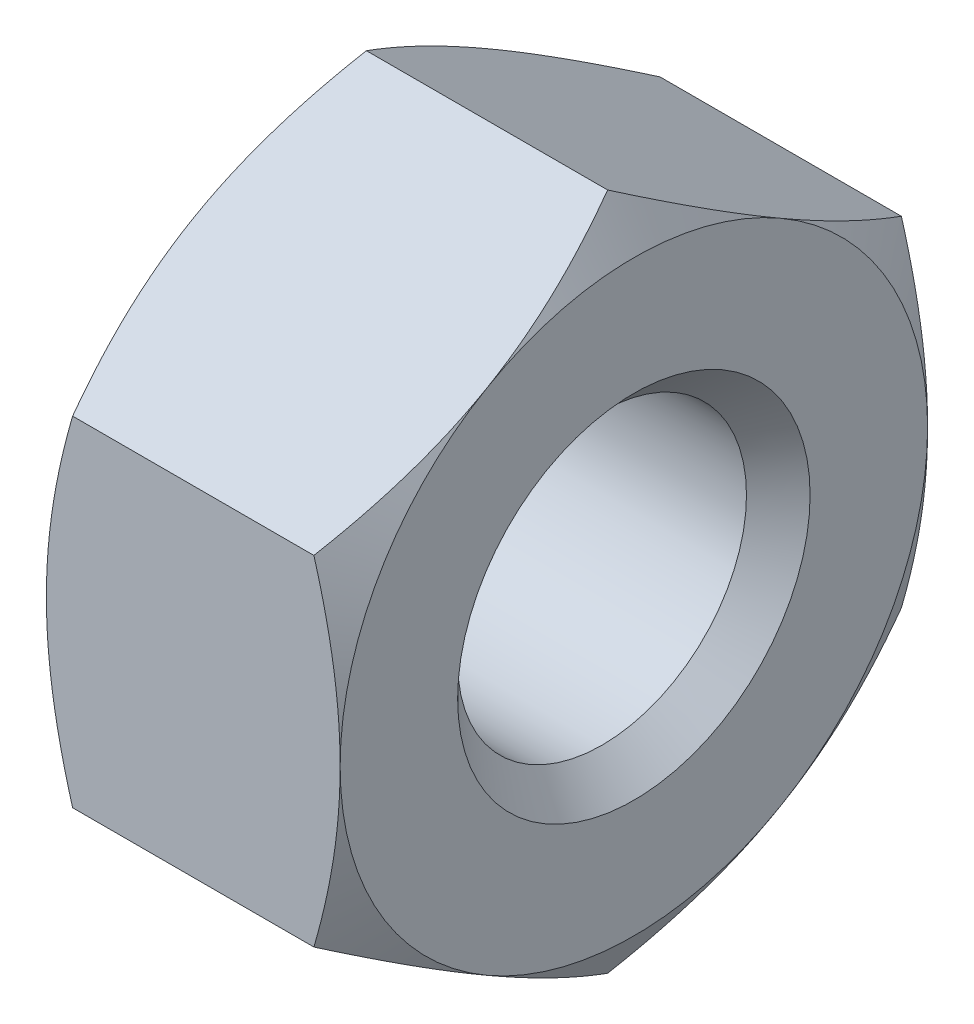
ISO-10303-21;
HEADER;
FILE_DESCRIPTION(('STEP AP214'),'2;1');
FILE_NAME('part.step','',(''),(''),'','','');
FILE_SCHEMA(('AUTOMOTIVE_DESIGN { 1 0 10303 214 1 1 1 1 }'));
ENDSEC;
DATA;
#1=APPLICATION_CONTEXT('core data for automotive mechanical design processes');
#2=APPLICATION_PROTOCOL_DEFINITION('international standard','automotive_design',2000,#1);
#3=PRODUCT_CONTEXT('',#1,'mechanical');
#4=PRODUCT('Part','Part','',(#3));
#5=PRODUCT_RELATED_PRODUCT_CATEGORY('part','',(#4));
#6=PRODUCT_DEFINITION_FORMATION('','',#4);
#7=PRODUCT_DEFINITION_CONTEXT('part definition',#1,'design');
#8=PRODUCT_DEFINITION('design','',#6,#7);
#9=PRODUCT_DEFINITION_SHAPE('','',#8);
#10=(LENGTH_UNIT() NAMED_UNIT(*) SI_UNIT(.MILLI.,.METRE.));
#11=(NAMED_UNIT(*) PLANE_ANGLE_UNIT() SI_UNIT($,.RADIAN.));
#12=(NAMED_UNIT(*) SI_UNIT($,.STERADIAN.) SOLID_ANGLE_UNIT());
#13=UNCERTAINTY_MEASURE_WITH_UNIT(LENGTH_MEASURE(1.E-05),#10,'distance_accuracy_value','');
#14=(GEOMETRIC_REPRESENTATION_CONTEXT(3) GLOBAL_UNCERTAINTY_ASSIGNED_CONTEXT((#13)) GLOBAL_UNIT_ASSIGNED_CONTEXT((#10,
#11,#12)) REPRESENTATION_CONTEXT('',''));
#15=CARTESIAN_POINT('',(0.,0.,0.));
#16=DIRECTION('',(0.,0.,1.));
#17=DIRECTION('',(1.,0.,0.));
#18=AXIS2_PLACEMENT_3D('',#15,#16,#17);
#19=CARTESIAN_POINT('',(5.,5.,0.));
#20=DIRECTION('',(-1.,0.,0.));
#21=DIRECTION('',(0.,0.,1.));
#22=AXIS2_PLACEMENT_3D('',#19,#20,#21);
#23=PLANE('',#22);
#24=CARTESIAN_POINT('',(4.99999999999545,0.,0.));
#25=DIRECTION('',(1.,0.,0.));
#26=DIRECTION('',(0.,0.,-1.));
#27=AXIS2_PLACEMENT_3D('',#24,#25,#26);
#28=CIRCLE('',#27,3.00000000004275);
#29=CARTESIAN_POINT('',(4.99999999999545,0.,-3.00000000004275));
#30=VERTEX_POINT('',#29);
#31=EDGE_CURVE('E273',#30,#30,#28,.F.);
#32=ORIENTED_EDGE('',*,*,#31,.T.);
#33=EDGE_LOOP('',(#32));
#34=FACE_BOUND('',#33,.T.);
#35=CARTESIAN_POINT('',(5.00000000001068,0.,0.));
#36=DIRECTION('',(-1.,0.,0.));
#37=DIRECTION('',(0.,0.,1.));
#38=AXIS2_PLACEMENT_3D('',#35,#36,#37);
#39=CIRCLE('',#38,4.99999999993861);
#40=CARTESIAN_POINT('',(4.99999999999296,-4.33012701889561,2.49999999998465));
#41=VERTEX_POINT('',#40);
#42=CARTESIAN_POINT('',(4.99999999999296,0.,4.99999999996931));
#43=VERTEX_POINT('',#42);
#44=EDGE_CURVE('E117',#41,#43,#39,.T.);
#45=ORIENTED_EDGE('',*,*,#44,.F.);
#46=CARTESIAN_POINT('',(5.00000000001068,0.,0.));
#47=DIRECTION('',(-1.,0.,0.));
#48=DIRECTION('',(0.,0.,1.));
#49=AXIS2_PLACEMENT_3D('',#46,#47,#48);
#50=CIRCLE('',#49,4.99999999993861);
#51=CARTESIAN_POINT('',(4.99999999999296,-4.33012701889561,-2.49999999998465));
#52=VERTEX_POINT('',#51);
#53=EDGE_CURVE('E20',#52,#41,#50,.T.);
#54=ORIENTED_EDGE('',*,*,#53,.F.);
#55=CARTESIAN_POINT('',(5.00000000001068,0.,0.));
#56=DIRECTION('',(-1.,0.,0.));
#57=DIRECTION('',(0.,0.,1.));
#58=AXIS2_PLACEMENT_3D('',#55,#56,#57);
#59=CIRCLE('',#58,4.99999999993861);
#60=CARTESIAN_POINT('',(4.99999999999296,0.,-4.99999999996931));
#61=VERTEX_POINT('',#60);
#62=EDGE_CURVE('E103',#61,#52,#59,.T.);
#63=ORIENTED_EDGE('',*,*,#62,.F.);
#64=CARTESIAN_POINT('',(5.00000000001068,0.,0.));
#65=DIRECTION('',(-1.,0.,0.));
#66=DIRECTION('',(0.,0.,1.));
#67=AXIS2_PLACEMENT_3D('',#64,#65,#66);
#68=CIRCLE('',#67,4.99999999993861);
#69=CARTESIAN_POINT('',(4.99999999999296,4.33012701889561,-2.49999999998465));
#70=VERTEX_POINT('',#69);
#71=EDGE_CURVE('E113',#70,#61,#68,.T.);
#72=ORIENTED_EDGE('',*,*,#71,.F.);
#73=CARTESIAN_POINT('',(5.00000000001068,0.,0.));
#74=DIRECTION('',(-1.,0.,0.));
#75=DIRECTION('',(0.,0.,1.));
#76=AXIS2_PLACEMENT_3D('',#73,#74,#75);
#77=CIRCLE('',#76,4.99999999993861);
#78=CARTESIAN_POINT('',(4.99999999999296,4.33012701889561,2.49999999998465));
#79=VERTEX_POINT('',#78);
#80=EDGE_CURVE('E414',#79,#70,#77,.T.);
#81=ORIENTED_EDGE('',*,*,#80,.F.);
#82=CARTESIAN_POINT('',(5.00000000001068,0.,0.));
#83=DIRECTION('',(-1.,0.,0.));
#84=DIRECTION('',(0.,0.,1.));
#85=AXIS2_PLACEMENT_3D('',#82,#83,#84);
#86=CIRCLE('',#85,4.99999999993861);
#87=EDGE_CURVE('E436',#43,#79,#86,.T.);
#88=ORIENTED_EDGE('',*,*,#87,.F.);
#89=EDGE_LOOP('',(#45,#54,#63,#72,#81,#88));
#90=FACE_BOUND('',#89,.T.);
#91=ADVANCED_FACE('F17',(#34,#90),#23,.F.);
#92=CARTESIAN_POINT('',(4.55073852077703,0.,0.));
#93=DIRECTION('',(-1.,0.,0.));
#94=DIRECTION('',(0.,0.,1.));
#95=AXIS2_PLACEMENT_3D('',#92,#93,#94);
#96=CONICAL_SURFACE('',#95,5.77814370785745,1.04719755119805);
#97=CARTESIAN_POINT('',(4.99999999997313,-4.33012701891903,2.49999999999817));
#98=CARTESIAN_POINT('',(5.00002043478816,-4.39139021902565,2.39388902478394));
#99=CARTESIAN_POINT('',(4.99740020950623,-4.45265046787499,2.28778316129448));
#100=CARTESIAN_POINT('',(4.98703032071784,-4.57505068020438,2.07577977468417));
#101=CARTESIAN_POINT('',(4.97928167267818,-4.63619066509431,1.96988221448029));
#102=CARTESIAN_POINT('',(4.95885784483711,-4.7579554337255,1.75897944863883));
#103=CARTESIAN_POINT('',(4.94620746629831,-4.8185812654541,1.6539724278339));
#104=CARTESIAN_POINT('',(4.91625229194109,-4.93954408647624,1.44445867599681));
#105=CARTESIAN_POINT('',(4.89894737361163,-4.99988106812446,1.3399519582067));
#106=CARTESIAN_POINT('',(4.84058540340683,-5.1802086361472,1.02761544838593));
#107=CARTESIAN_POINT('',(4.7930527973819,-5.2996753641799,0.820693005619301));
#108=CARTESIAN_POINT('',(4.6834304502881,-5.53758145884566,0.408627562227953));
#109=CARTESIAN_POINT('',(4.62126800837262,-5.6560125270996,0.203498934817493));
#110=CARTESIAN_POINT('',(4.55341801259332,-5.77350269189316,5.36820095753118E-12));
#111=B_SPLINE_CURVE_WITH_KNOTS('',3,(#97,#98,#99,#100,#101,#102,#103,#104,#105,#106,#107,#108,
#109,#110),.UNSPECIFIED.,.F.,.F.,(4,2,2,2,2,2,4),(0.,0.367541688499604,0.73501062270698,
1.10064405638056,1.46628711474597,2.19661488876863,2.93065154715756),.UNSPECIFIED.);
#112=CARTESIAN_POINT('',(4.55341801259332,-5.77350269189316,0.));
#113=VERTEX_POINT('',#112);
#114=EDGE_CURVE('E131',#41,#113,#111,.T.);
#115=ORIENTED_EDGE('',*,*,#114,.T.);
#116=CARTESIAN_POINT('',(4.55341801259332,-5.77350269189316,-5.36870951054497E-12));
#117=CARTESIAN_POINT('',(4.6212680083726,-5.6560125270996,-0.203498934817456));
#118=CARTESIAN_POINT('',(4.68343045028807,-5.53758145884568,-0.408627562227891));
#119=CARTESIAN_POINT('',(4.79305279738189,-5.29967536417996,-0.820693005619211));
#120=CARTESIAN_POINT('',(4.84058540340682,-5.18020863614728,-1.02761544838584));
#121=CARTESIAN_POINT('',(4.8989473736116,-4.99988106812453,-1.33995195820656));
#122=CARTESIAN_POINT('',(4.91625229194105,-4.93954408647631,-1.44445867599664));
#123=CARTESIAN_POINT('',(4.9462074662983,-4.81858126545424,-1.65397242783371));
#124=CARTESIAN_POINT('',(4.95885784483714,-4.75795543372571,-1.75897944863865));
#125=CARTESIAN_POINT('',(4.97928167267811,-4.63619066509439,-1.96988221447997));
#126=CARTESIAN_POINT('',(4.98703032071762,-4.57505068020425,-2.07577977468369));
#127=CARTESIAN_POINT('',(4.99740020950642,-4.45265046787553,-2.28778316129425));
#128=CARTESIAN_POINT('',(5.00002043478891,-4.39139021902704,-2.39388902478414));
#129=CARTESIAN_POINT('',(4.99999999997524,-4.3301270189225,-2.49999999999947));
#130=B_SPLINE_CURVE_WITH_KNOTS('',3,(#116,#117,#118,#119,#120,#121,#122,#123,#124,#125,#126,
#127,#128,#129),.UNSPECIFIED.,.F.,.F.,(4,2,2,2,2,2,4),(0.,0.734036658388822,1.46436443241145,
1.83000749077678,2.1956409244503,2.56310985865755,2.93065154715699),.UNSPECIFIED.);
#131=EDGE_CURVE('E125',#113,#52,#130,.T.);
#132=ORIENTED_EDGE('',*,*,#131,.T.);
#133=ORIENTED_EDGE('',*,*,#53,.T.);
#134=EDGE_LOOP('',(#115,#132,#133));
#135=FACE_BOUND('',#134,.T.);
#136=ADVANCED_FACE('F130',(#135),#96,.T.);
#137=CARTESIAN_POINT('',(4.55073852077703,0.,0.));
#138=DIRECTION('',(-1.,0.,0.));
#139=DIRECTION('',(0.,0.,1.));
#140=AXIS2_PLACEMENT_3D('',#137,#138,#139);
#141=CONICAL_SURFACE('',#140,5.77814370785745,1.04719755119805);
#142=CARTESIAN_POINT('',(4.99999999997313,-4.33012701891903,-2.49999999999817));
#143=CARTESIAN_POINT('',(5.00002043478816,-4.26886381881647,-2.60611097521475));
#144=CARTESIAN_POINT('',(4.99740020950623,-4.20760356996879,-2.71221683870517));
#145=CARTESIAN_POINT('',(4.98703032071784,-4.08520335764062,-2.92422022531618));
#146=CARTESIAN_POINT('',(4.97928167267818,-4.02406337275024,-3.0301177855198));
#147=CARTESIAN_POINT('',(4.95885784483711,-3.90229860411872,-3.24102055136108));
#148=CARTESIAN_POINT('',(4.94620746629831,-3.84167277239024,-3.34602757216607));
#149=CARTESIAN_POINT('',(4.91625229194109,-3.7207099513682,-3.55554132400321));
#150=CARTESIAN_POINT('',(4.89894737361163,-3.66037296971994,-3.6600480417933));
#151=CARTESIAN_POINT('',(4.84058540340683,-3.48004540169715,-3.97238455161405));
#152=CARTESIAN_POINT('',(4.7930527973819,-3.36057867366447,-4.17930699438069));
#153=CARTESIAN_POINT('',(4.6834304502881,-3.12267257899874,-4.59137243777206));
#154=CARTESIAN_POINT('',(4.62126800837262,-3.00424151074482,-4.79650106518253));
#155=CARTESIAN_POINT('',(4.55341801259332,-2.88675134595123,-4.99999999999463));
#156=B_SPLINE_CURVE_WITH_KNOTS('',3,(#142,#143,#144,#145,#146,#147,#148,#149,#150,#151,#152,
#153,#154,#155),.UNSPECIFIED.,.F.,.F.,(4,2,2,2,2,2,4),(0.,0.367541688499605,0.735010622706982,
1.10064405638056,1.46628711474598,2.19661488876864,2.93065154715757),.UNSPECIFIED.);
#157=CARTESIAN_POINT('',(4.55341801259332,-2.88675134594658,-4.99999999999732));
#158=VERTEX_POINT('',#157);
#159=EDGE_CURVE('E107',#52,#158,#156,.T.);
#160=ORIENTED_EDGE('',*,*,#159,.T.);
#161=CARTESIAN_POINT('',(4.55341801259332,-2.88675134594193,-5.));
#162=CARTESIAN_POINT('',(4.6212680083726,-2.65177101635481,-5.));
#163=CARTESIAN_POINT('',(4.68343045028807,-2.41490887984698,-5.));
#164=CARTESIAN_POINT('',(4.79305279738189,-1.93909669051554,-5.));
#165=CARTESIAN_POINT('',(4.84058540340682,-1.70016323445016,-5.));
#166=CARTESIAN_POINT('',(4.8989473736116,-1.33950809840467,-5.));
#167=CARTESIAN_POINT('',(4.91625229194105,-1.21883413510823,-5.));
#168=CARTESIAN_POINT('',(4.9462074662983,-0.9769084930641,-5.));
#169=CARTESIAN_POINT('',(4.95885784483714,-0.855656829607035,-5.));
#170=CARTESIAN_POINT('',(4.97928167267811,-0.612127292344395,-5.));
#171=CARTESIAN_POINT('',(4.98703032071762,-0.489847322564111,-5.));
#172=CARTESIAN_POINT('',(4.99740020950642,-0.245046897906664,-5.));
#173=CARTESIAN_POINT('',(5.00002043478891,-0.122526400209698,-5.));
#174=CARTESIAN_POINT('',(4.99999999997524,-6.07761212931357E-13,-5.));
#175=B_SPLINE_CURVE_WITH_KNOTS('',3,(#161,#162,#163,#164,#165,#166,#167,#168,#169,#170,#171,
#172,#173,#174),.UNSPECIFIED.,.F.,.F.,(4,2,2,2,2,2,4),(0.,0.734036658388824,1.46436443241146,
1.83000749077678,2.1956409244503,2.56310985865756,2.930651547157),.UNSPECIFIED.);
#176=EDGE_CURVE('E109',#158,#61,#175,.T.);
#177=ORIENTED_EDGE('',*,*,#176,.T.);
#178=ORIENTED_EDGE('',*,*,#62,.T.);
#179=EDGE_LOOP('',(#160,#177,#178));
#180=FACE_BOUND('',#179,.T.);
#181=ADVANCED_FACE('F105',(#180),#141,.T.);
#182=CARTESIAN_POINT('',(4.55073852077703,0.,0.));
#183=DIRECTION('',(-1.,0.,0.));
#184=DIRECTION('',(0.,0.,1.));
#185=AXIS2_PLACEMENT_3D('',#182,#183,#184);
#186=CONICAL_SURFACE('',#185,5.77814370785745,1.04719755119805);
#187=CARTESIAN_POINT('',(4.99999999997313,0.,-4.99999999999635));
#188=CARTESIAN_POINT('',(5.00002043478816,0.122526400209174,-4.99999999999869));
#189=CARTESIAN_POINT('',(4.99740020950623,0.245046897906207,-4.99999999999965));
#190=CARTESIAN_POINT('',(4.98703032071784,0.489847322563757,-5.00000000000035));
#191=CARTESIAN_POINT('',(4.97928167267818,0.612127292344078,-5.0000000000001));
#192=CARTESIAN_POINT('',(4.95885784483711,0.855656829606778,-4.99999999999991));
#193=CARTESIAN_POINT('',(4.94620746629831,0.976908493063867,-4.99999999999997));
#194=CARTESIAN_POINT('',(4.91625229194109,1.21883413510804,-5.00000000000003));
#195=CARTESIAN_POINT('',(4.89894737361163,1.33950809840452,-5.00000000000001));
#196=CARTESIAN_POINT('',(4.84058540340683,1.70016323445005,-4.99999999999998));
#197=CARTESIAN_POINT('',(4.7930527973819,1.93909669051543,-4.99999999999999));
#198=CARTESIAN_POINT('',(4.6834304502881,2.41490887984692,-5.00000000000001));
#199=CARTESIAN_POINT('',(4.62126800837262,2.65177101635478,-5.00000000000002));
#200=CARTESIAN_POINT('',(4.55341801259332,2.88675134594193,-5.));
#201=B_SPLINE_CURVE_WITH_KNOTS('',3,(#187,#188,#189,#190,#191,#192,#193,#194,#195,#196,#197,
#198,#199,#200),.UNSPECIFIED.,.F.,.F.,(4,2,2,2,2,2,4),(0.,0.367541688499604,0.735010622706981,
1.10064405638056,1.46628711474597,2.19661488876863,2.93065154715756),.UNSPECIFIED.);
#202=CARTESIAN_POINT('',(4.55341801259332,2.88675134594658,-4.99999999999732));
#203=VERTEX_POINT('',#202);
#204=EDGE_CURVE('E166',#61,#203,#201,.T.);
#205=ORIENTED_EDGE('',*,*,#204,.T.);
#206=CARTESIAN_POINT('',(4.55341801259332,2.88675134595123,-4.99999999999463));
#207=CARTESIAN_POINT('',(4.6212680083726,3.00424151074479,-4.79650106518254));
#208=CARTESIAN_POINT('',(4.68343045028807,3.1226725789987,-4.59137243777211));
#209=CARTESIAN_POINT('',(4.79305279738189,3.36057867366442,-4.17930699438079));
#210=CARTESIAN_POINT('',(4.84058540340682,3.48004540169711,-3.97238455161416));
#211=CARTESIAN_POINT('',(4.89894737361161,3.66037296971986,-3.66004804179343));
#212=CARTESIAN_POINT('',(4.91625229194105,3.72070995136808,-3.55554132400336));
#213=CARTESIAN_POINT('',(4.9462074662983,3.84167277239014,-3.34602757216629));
#214=CARTESIAN_POINT('',(4.95885784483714,3.90229860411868,-3.24102055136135));
#215=CARTESIAN_POINT('',(4.97928167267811,4.02406337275,-3.03011778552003));
#216=CARTESIAN_POINT('',(4.98703032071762,4.08520335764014,-2.92422022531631));
#217=CARTESIAN_POINT('',(4.99740020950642,4.20760356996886,-2.71221683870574));
#218=CARTESIAN_POINT('',(5.00002043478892,4.26886381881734,-2.60611097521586));
#219=CARTESIAN_POINT('',(4.99999999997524,4.33012701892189,-2.50000000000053));
#220=B_SPLINE_CURVE_WITH_KNOTS('',3,(#206,#207,#208,#209,#210,#211,#212,#213,#214,#215,#216,
#217,#218,#219),.UNSPECIFIED.,.F.,.F.,(4,2,2,2,2,2,4),(0.,0.734036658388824,1.46436443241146,
1.83000749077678,2.1956409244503,2.56310985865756,2.930651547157),.UNSPECIFIED.);
#221=EDGE_CURVE('E378',#203,#70,#220,.T.);
#222=ORIENTED_EDGE('',*,*,#221,.T.);
#223=ORIENTED_EDGE('',*,*,#71,.T.);
#224=EDGE_LOOP('',(#205,#222,#223));
#225=FACE_BOUND('',#224,.T.);
#226=ADVANCED_FACE('F158',(#225),#186,.T.);
#227=CARTESIAN_POINT('',(4.55073852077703,0.,0.));
#228=DIRECTION('',(-1.,0.,0.));
#229=DIRECTION('',(0.,0.,1.));
#230=AXIS2_PLACEMENT_3D('',#227,#228,#229);
#231=CONICAL_SURFACE('',#230,5.77814370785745,1.04719755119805);
#232=CARTESIAN_POINT('',(4.99999999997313,0.,4.99999999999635));
#233=CARTESIAN_POINT('',(5.00002043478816,-0.122526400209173,4.99999999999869));
#234=CARTESIAN_POINT('',(4.99740020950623,-0.245046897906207,4.99999999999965));
#235=CARTESIAN_POINT('',(4.98703032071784,-0.489847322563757,5.00000000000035));
#236=CARTESIAN_POINT('',(4.97928167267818,-0.612127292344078,5.0000000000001));
#237=CARTESIAN_POINT('',(4.95885784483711,-0.855656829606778,4.99999999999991));
#238=CARTESIAN_POINT('',(4.94620746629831,-0.976908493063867,4.99999999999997));
#239=CARTESIAN_POINT('',(4.91625229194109,-1.21883413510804,5.00000000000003));
#240=CARTESIAN_POINT('',(4.89894737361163,-1.33950809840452,5.00000000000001));
#241=CARTESIAN_POINT('',(4.84058540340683,-1.70016323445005,4.99999999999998));
#242=CARTESIAN_POINT('',(4.7930527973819,-1.93909669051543,4.99999999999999));
#243=CARTESIAN_POINT('',(4.6834304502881,-2.41490887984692,5.00000000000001));
#244=CARTESIAN_POINT('',(4.62126800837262,-2.65177101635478,5.00000000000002));
#245=CARTESIAN_POINT('',(4.55341801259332,-2.88675134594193,5.));
#246=B_SPLINE_CURVE_WITH_KNOTS('',3,(#232,#233,#234,#235,#236,#237,#238,#239,#240,#241,#242,
#243,#244,#245),.UNSPECIFIED.,.F.,.F.,(4,2,2,2,2,2,4),(0.,0.367541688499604,0.735010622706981,
1.10064405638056,1.46628711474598,2.19661488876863,2.93065154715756),.UNSPECIFIED.);
#247=CARTESIAN_POINT('',(4.55341801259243,-2.88675134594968,4.99999999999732));
#248=VERTEX_POINT('',#247);
#249=EDGE_CURVE('E284',#43,#248,#246,.T.);
#250=ORIENTED_EDGE('',*,*,#249,.T.);
#251=CARTESIAN_POINT('',(4.55341801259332,-2.88675134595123,4.99999999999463));
#252=CARTESIAN_POINT('',(4.6212680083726,-3.00424151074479,4.79650106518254));
#253=CARTESIAN_POINT('',(4.68343045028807,-3.1226725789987,4.59137243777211));
#254=CARTESIAN_POINT('',(4.79305279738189,-3.36057867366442,4.17930699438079));
#255=CARTESIAN_POINT('',(4.84058540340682,-3.48004540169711,3.97238455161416));
#256=CARTESIAN_POINT('',(4.8989473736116,-3.66037296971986,3.66004804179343));
#257=CARTESIAN_POINT('',(4.91625229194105,-3.72070995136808,3.55554132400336));
#258=CARTESIAN_POINT('',(4.9462074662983,-3.84167277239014,3.34602757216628));
#259=CARTESIAN_POINT('',(4.95885784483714,-3.90229860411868,3.24102055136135));
#260=CARTESIAN_POINT('',(4.97928167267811,-4.02406337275,3.03011778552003));
#261=CARTESIAN_POINT('',(4.98703032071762,-4.08520335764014,2.92422022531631));
#262=CARTESIAN_POINT('',(4.99740020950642,-4.20760356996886,2.71221683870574));
#263=CARTESIAN_POINT('',(5.00002043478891,-4.26886381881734,2.60611097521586));
#264=CARTESIAN_POINT('',(4.99999999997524,-4.33012701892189,2.50000000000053));
#265=B_SPLINE_CURVE_WITH_KNOTS('',3,(#251,#252,#253,#254,#255,#256,#257,#258,#259,#260,#261,
#262,#263,#264),.UNSPECIFIED.,.F.,.F.,(4,2,2,2,2,2,4),(0.,0.734036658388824,1.46436443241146,
1.83000749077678,2.1956409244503,2.56310985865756,2.930651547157),.UNSPECIFIED.);
#266=EDGE_CURVE('E267',#248,#41,#265,.T.);
#267=ORIENTED_EDGE('',*,*,#266,.T.);
#268=ORIENTED_EDGE('',*,*,#44,.T.);
#269=EDGE_LOOP('',(#250,#267,#268));
#270=FACE_BOUND('',#269,.T.);
#271=ADVANCED_FACE('F275',(#270),#231,.T.);
#272=CARTESIAN_POINT('',(4.55073852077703,0.,0.));
#273=DIRECTION('',(-1.,0.,0.));
#274=DIRECTION('',(0.,0.,1.));
#275=AXIS2_PLACEMENT_3D('',#272,#273,#274);
#276=CONICAL_SURFACE('',#275,5.77814370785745,1.04719755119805);
#277=CARTESIAN_POINT('',(4.55341801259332,5.77350269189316,5.3686406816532E-12));
#278=CARTESIAN_POINT('',(4.6212680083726,5.6560125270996,0.203498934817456));
#279=CARTESIAN_POINT('',(4.68343045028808,5.53758145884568,0.408627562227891));
#280=CARTESIAN_POINT('',(4.79305279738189,5.29967536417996,0.820693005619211));
#281=CARTESIAN_POINT('',(4.84058540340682,5.18020863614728,1.02761544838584));
#282=CARTESIAN_POINT('',(4.8989473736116,4.99988106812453,1.33995195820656));
#283=CARTESIAN_POINT('',(4.91625229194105,4.93954408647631,1.44445867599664));
#284=CARTESIAN_POINT('',(4.9462074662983,4.81858126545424,1.65397242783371));
#285=CARTESIAN_POINT('',(4.95885784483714,4.75795543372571,1.75897944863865));
#286=CARTESIAN_POINT('',(4.97928167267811,4.63619066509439,1.96988221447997));
#287=CARTESIAN_POINT('',(4.98703032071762,4.57505068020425,2.07577977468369));
#288=CARTESIAN_POINT('',(4.99740020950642,4.45265046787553,2.28778316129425));
#289=CARTESIAN_POINT('',(5.00002043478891,4.39139021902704,2.39388902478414));
#290=CARTESIAN_POINT('',(4.99999999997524,4.3301270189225,2.49999999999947));
#291=B_SPLINE_CURVE_WITH_KNOTS('',3,(#277,#278,#279,#280,#281,#282,#283,#284,#285,#286,#287,
#288,#289,#290),.UNSPECIFIED.,.F.,.F.,(4,2,2,2,2,2,4),(0.,0.734036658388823,1.46436443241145,
1.83000749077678,2.1956409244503,2.56310985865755,2.93065154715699),.UNSPECIFIED.);
#292=CARTESIAN_POINT('',(4.55341801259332,5.77350269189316,0.));
#293=VERTEX_POINT('',#292);
#294=EDGE_CURVE('E293',#293,#79,#291,.T.);
#295=ORIENTED_EDGE('',*,*,#294,.T.);
#296=ORIENTED_EDGE('',*,*,#80,.T.);
#297=CARTESIAN_POINT('',(4.99999999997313,4.33012701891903,-2.49999999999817));
#298=CARTESIAN_POINT('',(5.00002043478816,4.39139021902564,-2.39388902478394));
#299=CARTESIAN_POINT('',(4.99740020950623,4.45265046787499,-2.28778316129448));
#300=CARTESIAN_POINT('',(4.98703032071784,4.57505068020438,-2.07577977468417));
#301=CARTESIAN_POINT('',(4.97928167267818,4.63619066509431,-1.96988221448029));
#302=CARTESIAN_POINT('',(4.95885784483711,4.7579554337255,-1.75897944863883));
#303=CARTESIAN_POINT('',(4.94620746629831,4.8185812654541,-1.6539724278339));
#304=CARTESIAN_POINT('',(4.91625229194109,4.93954408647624,-1.44445867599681));
#305=CARTESIAN_POINT('',(4.89894737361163,4.99988106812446,-1.33995195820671));
#306=CARTESIAN_POINT('',(4.84058540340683,5.1802086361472,-1.02761544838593));
#307=CARTESIAN_POINT('',(4.7930527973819,5.2996753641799,-0.820693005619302));
#308=CARTESIAN_POINT('',(4.6834304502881,5.53758145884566,-0.408627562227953));
#309=CARTESIAN_POINT('',(4.62126800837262,5.6560125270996,-0.203498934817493));
#310=CARTESIAN_POINT('',(4.55341801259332,5.77350269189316,-5.36747606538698E-12));
#311=B_SPLINE_CURVE_WITH_KNOTS('',3,(#297,#298,#299,#300,#301,#302,#303,#304,#305,#306,#307,
#308,#309,#310),.UNSPECIFIED.,.F.,.F.,(4,2,2,2,2,2,4),(0.,0.367541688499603,0.735010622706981,
1.10064405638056,1.46628711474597,2.19661488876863,2.93065154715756),.UNSPECIFIED.);
#312=EDGE_CURVE('E416',#70,#293,#311,.T.);
#313=ORIENTED_EDGE('',*,*,#312,.T.);
#314=EDGE_LOOP('',(#295,#296,#313));
#315=FACE_BOUND('',#314,.T.);
#316=ADVANCED_FACE('F279',(#315),#276,.T.);
#317=CARTESIAN_POINT('',(4.55073852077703,0.,0.));
#318=DIRECTION('',(-1.,0.,0.));
#319=DIRECTION('',(0.,0.,1.));
#320=AXIS2_PLACEMENT_3D('',#317,#318,#319);
#321=CONICAL_SURFACE('',#320,5.77814370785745,1.04719755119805);
#322=CARTESIAN_POINT('',(4.99999999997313,4.33012701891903,2.49999999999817));
#323=CARTESIAN_POINT('',(5.00002043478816,4.26886381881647,2.60611097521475));
#324=CARTESIAN_POINT('',(4.99740020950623,4.20760356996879,2.71221683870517));
#325=CARTESIAN_POINT('',(4.98703032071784,4.08520335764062,2.92422022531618));
#326=CARTESIAN_POINT('',(4.97928167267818,4.02406337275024,3.0301177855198));
#327=CARTESIAN_POINT('',(4.95885784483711,3.90229860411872,3.24102055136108));
#328=CARTESIAN_POINT('',(4.94620746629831,3.84167277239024,3.34602757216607));
#329=CARTESIAN_POINT('',(4.91625229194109,3.72070995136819,3.55554132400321));
#330=CARTESIAN_POINT('',(4.89894737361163,3.66037296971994,3.6600480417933));
#331=CARTESIAN_POINT('',(4.84058540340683,3.48004540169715,3.97238455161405));
#332=CARTESIAN_POINT('',(4.7930527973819,3.36057867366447,4.17930699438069));
#333=CARTESIAN_POINT('',(4.6834304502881,3.12267257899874,4.59137243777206));
#334=CARTESIAN_POINT('',(4.62126800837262,3.00424151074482,4.79650106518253));
#335=CARTESIAN_POINT('',(4.55341801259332,2.88675134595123,4.99999999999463));
#336=B_SPLINE_CURVE_WITH_KNOTS('',3,(#322,#323,#324,#325,#326,#327,#328,#329,#330,#331,#332,
#333,#334,#335),.UNSPECIFIED.,.F.,.F.,(4,2,2,2,2,2,4),(0.,0.367541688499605,0.735010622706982,
1.10064405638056,1.46628711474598,2.19661488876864,2.93065154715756),.UNSPECIFIED.);
#337=CARTESIAN_POINT('',(4.55341801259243,2.88675134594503,5.));
#338=VERTEX_POINT('',#337);
#339=EDGE_CURVE('E386',#79,#338,#336,.T.);
#340=ORIENTED_EDGE('',*,*,#339,.T.);
#341=CARTESIAN_POINT('',(4.55341801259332,2.88675134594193,5.));
#342=CARTESIAN_POINT('',(4.6212680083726,2.65177101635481,5.));
#343=CARTESIAN_POINT('',(4.68343045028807,2.41490887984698,5.));
#344=CARTESIAN_POINT('',(4.79305279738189,1.93909669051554,5.));
#345=CARTESIAN_POINT('',(4.84058540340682,1.70016323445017,5.));
#346=CARTESIAN_POINT('',(4.8989473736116,1.33950809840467,5.));
#347=CARTESIAN_POINT('',(4.91625229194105,1.21883413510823,5.));
#348=CARTESIAN_POINT('',(4.9462074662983,0.976908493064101,5.));
#349=CARTESIAN_POINT('',(4.95885784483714,0.855656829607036,5.));
#350=CARTESIAN_POINT('',(4.97928167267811,0.612127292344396,5.));
#351=CARTESIAN_POINT('',(4.98703032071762,0.489847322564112,5.));
#352=CARTESIAN_POINT('',(4.99740020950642,0.245046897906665,5.));
#353=CARTESIAN_POINT('',(5.00002043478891,0.122526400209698,5.));
#354=CARTESIAN_POINT('',(4.99999999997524,6.08181261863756E-13,5.));
#355=B_SPLINE_CURVE_WITH_KNOTS('',3,(#341,#342,#343,#344,#345,#346,#347,#348,#349,#350,#351,
#352,#353,#354),.UNSPECIFIED.,.F.,.F.,(4,2,2,2,2,2,4),(0.,0.734036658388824,1.46436443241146,
1.83000749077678,2.1956409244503,2.56310985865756,2.930651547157),.UNSPECIFIED.);
#356=EDGE_CURVE('E292',#338,#43,#355,.T.);
#357=ORIENTED_EDGE('',*,*,#356,.T.);
#358=ORIENTED_EDGE('',*,*,#87,.T.);
#359=EDGE_LOOP('',(#340,#357,#358));
#360=FACE_BOUND('',#359,.T.);
#361=ADVANCED_FACE('F400',(#360),#321,.T.);
#362=CARTESIAN_POINT('',(4.99999999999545,0.,0.));
#363=DIRECTION('',(1.,0.,0.));
#364=DIRECTION('',(0.,0.,-1.));
#365=AXIS2_PLACEMENT_3D('',#362,#363,#364);
#366=CONICAL_SURFACE('',#365,3.00000000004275,0.785398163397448);
#367=CARTESIAN_POINT('',(4.4585,0.,0.));
#368=DIRECTION('',(-1.,0.,0.));
#369=DIRECTION('',(0.,0.,1.));
#370=AXIS2_PLACEMENT_3D('',#367,#368,#369);
#371=CIRCLE('',#370,2.4585);
#372=CARTESIAN_POINT('',(4.4585,0.,2.4585));
#373=VERTEX_POINT('',#372);
#374=EDGE_CURVE('E370',#373,#373,#371,.T.);
#375=ORIENTED_EDGE('',*,*,#374,.T.);
#376=EDGE_LOOP('',(#375));
#377=FACE_BOUND('',#376,.T.);
#378=ORIENTED_EDGE('',*,*,#31,.F.);
#379=EDGE_LOOP('',(#378));
#380=FACE_BOUND('',#379,.T.);
#381=ADVANCED_FACE('F255',(#377,#380),#366,.F.);
#382=CARTESIAN_POINT('',(10.,-2.88675134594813,5.));
#383=DIRECTION('',(0.,0.866025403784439,-0.5));
#384=DIRECTION('',(0.,0.5,0.866025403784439));
#385=AXIS2_PLACEMENT_3D('',#382,#383,#384);
#386=PLANE('',#385);
#387=ORIENTED_EDGE('',*,*,#114,.F.);
#388=ORIENTED_EDGE('',*,*,#266,.F.);
#389=DIRECTION('',(-1.,0.,0.));
#390=VECTOR('',#389,1.);
#391=CARTESIAN_POINT('',(10.,-2.88675134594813,5.));
#392=LINE('',#391,#390);
#393=CARTESIAN_POINT('',(0.446581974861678,-2.8867513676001,4.99999996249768));
#394=VERTEX_POINT('',#393);
#395=EDGE_CURVE('E291',#248,#394,#392,.T.);
#396=ORIENTED_EDGE('',*,*,#395,.T.);
#397=CARTESIAN_POINT('',(2.6256649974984E-12,-4.33012701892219,2.5));
#398=CARTESIAN_POINT('',(-2.04348085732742E-05,-4.26886382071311,2.6061109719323));
#399=CARTESIAN_POINT('',(0.00259979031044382,-4.20760357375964,2.71221683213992));
#400=CARTESIAN_POINT('',(0.012969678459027,-4.08520336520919,2.92422021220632));
#401=CARTESIAN_POINT('',(0.0207183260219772,-4.02406338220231,3.03011776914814));
#402=CARTESIAN_POINT('',(0.0411421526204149,-3.90229861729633,3.24102052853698));
#403=CARTESIAN_POINT('',(0.0537925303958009,-3.84167278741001,3.34602754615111));
#404=CARTESIAN_POINT('',(0.0837477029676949,-3.72070997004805,3.5555412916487));
#405=CARTESIAN_POINT('',(0.1010526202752,-3.66037299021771,3.66004800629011));
#406=CARTESIAN_POINT('',(0.159414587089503,-3.48004542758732,3.97238450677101));
#407=CARTESIAN_POINT('',(0.206947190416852,-3.36057870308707,4.17930694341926));
#408=CARTESIAN_POINT('',(0.316569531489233,-3.12267261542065,4.59137237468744));
#409=CARTESIAN_POINT('',(0.378731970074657,-3.00424155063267,4.7965009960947));
#410=CARTESIAN_POINT('',(0.44658196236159,-2.88675138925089,4.99999992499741));
#411=B_SPLINE_CURVE_WITH_KNOTS('',3,(#397,#398,#399,#400,#401,#402,#403,#404,#405,#406,#407,
#408,#409,#410),.UNSPECIFIED.,.F.,.F.,(4,2,2,2,2,2,4),(0.,0.367541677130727,0.735010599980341,
1.10064402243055,1.46628706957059,2.19661482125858,2.93065145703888),.UNSPECIFIED.);
#412=CARTESIAN_POINT('',(1.31250900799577E-12,-4.33012701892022,2.49999999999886));
#413=VERTEX_POINT('',#412);
#414=EDGE_CURVE('E261',#413,#394,#411,.T.);
#415=ORIENTED_EDGE('',*,*,#414,.F.);
#416=CARTESIAN_POINT('',(0.446581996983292,-5.77350270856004,-2.88625193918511E-08));
#417=CARTESIAN_POINT('',(0.378731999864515,-5.6560125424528,0.203498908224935));
#418=CARTESIAN_POINT('',(0.31656955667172,-5.53758147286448,0.408627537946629));
#419=CARTESIAN_POINT('',(0.206947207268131,-5.29967537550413,0.820692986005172));
#420=CARTESIAN_POINT('',(0.15941460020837,-5.18020864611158,1.02761543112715));
#421=CARTESIAN_POINT('',(0.101052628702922,-4.99988107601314,1.33995194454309));
#422=CARTESIAN_POINT('',(0.0837477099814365,-4.93954409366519,1.44445866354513));
#423=CARTESIAN_POINT('',(0.0537925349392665,-4.81858127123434,1.65397241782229));
#424=CARTESIAN_POINT('',(0.0411421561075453,-4.75795543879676,1.75897943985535));
#425=CARTESIAN_POINT('',(0.0207183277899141,-4.63619066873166,1.96988220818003));
#426=CARTESIAN_POINT('',(0.0129696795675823,-4.57505068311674,2.07577976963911));
#427=CARTESIAN_POINT('',(0.00259979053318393,-4.45265046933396,2.28778315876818));
#428=CARTESIAN_POINT('',(-2.04348120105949E-05,-4.39139021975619,2.39388902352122));
#429=CARTESIAN_POINT('',(2.62539434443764E-12,-4.3301270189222,2.5));
#430=B_SPLINE_CURVE_WITH_KNOTS('',3,(#416,#417,#418,#419,#420,#421,#422,#423,#424,#425,#426,
#427,#428,#429),.UNSPECIFIED.,.F.,.F.,(4,2,2,2,2,2,4),(0.,0.734036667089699,1.46436444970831,
1.83000751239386,2.19564095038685,2.56310988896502,2.93065158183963),.UNSPECIFIED.);
#431=CARTESIAN_POINT('',(0.446581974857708,-5.77350267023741,-3.75142304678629E-08));
#432=VERTEX_POINT('',#431);
#433=EDGE_CURVE('E234',#432,#413,#430,.T.);
#434=ORIENTED_EDGE('',*,*,#433,.F.);
#435=DIRECTION('',(1.,0.,0.));
#436=VECTOR('',#435,1.);
#437=CARTESIAN_POINT('',(10.,-5.77350269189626,0.));
#438=LINE('',#437,#436);
#439=EDGE_CURVE('E132',#432,#113,#438,.T.);
#440=ORIENTED_EDGE('',*,*,#439,.T.);
#441=EDGE_LOOP('',(#387,#388,#396,#415,#434,#440));
#442=FACE_BOUND('',#441,.T.);
#443=ADVANCED_FACE('F251',(#442),#386,.F.);
#444=CARTESIAN_POINT('',(10.,-5.77350269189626,0.));
#445=DIRECTION('',(0.,0.866025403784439,0.5));
#446=DIRECTION('',(0.,-0.5,0.866025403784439));
#447=AXIS2_PLACEMENT_3D('',#444,#445,#446);
#448=PLANE('',#447);
#449=ORIENTED_EDGE('',*,*,#159,.F.);
#450=ORIENTED_EDGE('',*,*,#131,.F.);
#451=ORIENTED_EDGE('',*,*,#439,.F.);
#452=CARTESIAN_POINT('',(2.62555013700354E-12,-4.3301270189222,-2.5));
#453=CARTESIAN_POINT('',(-2.04348085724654E-05,-4.39139021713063,-2.39388902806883));
#454=CARTESIAN_POINT('',(0.00259979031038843,-4.45265046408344,-2.28778316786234));
#455=CARTESIAN_POINT('',(0.0129696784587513,-4.57505067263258,-2.0757797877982));
#456=CARTESIAN_POINT('',(0.0207183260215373,-4.63619065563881,-1.96988223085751));
#457=CARTESIAN_POINT('',(0.0411421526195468,-4.75795542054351,-1.75897947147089));
#458=CARTESIAN_POINT('',(0.0537925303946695,-4.81858125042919,-1.65397245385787));
#459=CARTESIAN_POINT('',(0.083747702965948,-4.93954406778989,-1.44445870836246));
#460=CARTESIAN_POINT('',(0.101052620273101,-4.99988104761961,-1.33995199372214));
#461=CARTESIAN_POINT('',(0.159414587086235,-5.18020861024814,-1.02761549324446));
#462=CARTESIAN_POINT('',(0.206947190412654,-5.29967533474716,-0.820693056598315));
#463=CARTESIAN_POINT('',(0.31656953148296,-5.53758142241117,-0.408627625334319));
#464=CARTESIAN_POINT('',(0.378731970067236,-5.65601248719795,-0.203499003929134));
#465=CARTESIAN_POINT('',(0.446581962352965,-5.77350264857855,-7.50284614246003E-08));
#466=B_SPLINE_CURVE_WITH_KNOTS('',3,(#452,#453,#454,#455,#456,#457,#458,#459,#460,#461,#462,
#463,#464,#465),.UNSPECIFIED.,.F.,.F.,(4,2,2,2,2,2,4),(0.,0.367541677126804,0.735010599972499,
1.10064402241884,1.46628706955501,2.19661482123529,2.93065145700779),.UNSPECIFIED.);
#467=CARTESIAN_POINT('',(1.31278522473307E-12,-4.33012701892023,-2.49999999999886));
#468=VERTEX_POINT('',#467);
#469=EDGE_CURVE('E236',#468,#432,#466,.T.);
#470=ORIENTED_EDGE('',*,*,#469,.F.);
#471=CARTESIAN_POINT('',(0.44658199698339,-2.88675132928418,-5.00000002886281));
#472=CARTESIAN_POINT('',(0.3787319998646,-3.00424149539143,-4.79650109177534));
#473=CARTESIAN_POINT('',(0.316569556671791,-3.12267256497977,-4.59137246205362));
#474=CARTESIAN_POINT('',(0.206947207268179,-3.36057866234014,-4.17930701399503));
#475=CARTESIAN_POINT('',(0.159414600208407,-3.4800453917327,-3.97238456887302));
#476=CARTESIAN_POINT('',(0.101052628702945,-3.66037296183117,-3.66004805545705));
#477=CARTESIAN_POINT('',(0.0837477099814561,-3.72070994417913,-3.55554133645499));
#478=CARTESIAN_POINT('',(0.0537925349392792,-3.84167276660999,-3.34602758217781));
#479=CARTESIAN_POINT('',(0.0411421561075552,-3.90229859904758,-3.24102056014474));
#480=CARTESIAN_POINT('',(0.0207183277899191,-4.02406336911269,-3.03011779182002));
#481=CARTESIAN_POINT('',(0.0129696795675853,-4.08520335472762,-2.92422023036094));
#482=CARTESIAN_POINT('',(0.00259979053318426,-4.20760356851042,-2.71221684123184));
#483=CARTESIAN_POINT('',(-2.04348120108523E-05,-4.26886381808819,-2.60611097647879));
#484=CARTESIAN_POINT('',(2.62554093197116E-12,-4.33012701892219,-2.5));
#485=B_SPLINE_CURVE_WITH_KNOTS('',3,(#471,#472,#473,#474,#475,#476,#477,#478,#479,#480,#481,
#482,#483,#484),.UNSPECIFIED.,.F.,.F.,(4,2,2,2,2,2,4),(0.,0.734036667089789,1.46436444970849,
1.83000751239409,2.19564095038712,2.56310988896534,2.93065158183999),.UNSPECIFIED.);
#486=CARTESIAN_POINT('',(0.44658197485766,-2.88675130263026,-5.));
#487=VERTEX_POINT('',#486);
#488=EDGE_CURVE('E226',#487,#468,#485,.T.);
#489=ORIENTED_EDGE('',*,*,#488,.F.);
#490=DIRECTION('',(1.,0.,0.));
#491=VECTOR('',#490,1.);
#492=CARTESIAN_POINT('',(10.,-2.88675134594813,-5.));
#493=LINE('',#492,#491);
#494=EDGE_CURVE('E128',#487,#158,#493,.T.);
#495=ORIENTED_EDGE('',*,*,#494,.T.);
#496=EDGE_LOOP('',(#449,#450,#451,#470,#489,#495));
#497=FACE_BOUND('',#496,.T.);
#498=ADVANCED_FACE('F124',(#497),#448,.F.);
#499=CARTESIAN_POINT('',(10.,-2.88675134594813,-5.));
#500=DIRECTION('',(0.,0.,1.));
#501=DIRECTION('',(1.,0.,0.));
#502=AXIS2_PLACEMENT_3D('',#499,#500,#501);
#503=PLANE('',#502);
#504=ORIENTED_EDGE('',*,*,#204,.F.);
#505=ORIENTED_EDGE('',*,*,#176,.F.);
#506=ORIENTED_EDGE('',*,*,#494,.F.);
#507=CARTESIAN_POINT('',(2.6255451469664E-12,0.,-5.));
#508=CARTESIAN_POINT('',(-2.04348085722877E-05,-0.122526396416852,-5.));
#509=CARTESIAN_POINT('',(0.002599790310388,-0.24504689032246,-5.));
#510=CARTESIAN_POINT('',(0.0129696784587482,-0.48984730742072,-5.));
#511=CARTESIAN_POINT('',(0.0207183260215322,-0.612127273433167,-5.));
#512=CARTESIAN_POINT('',(0.0411421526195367,-0.85565680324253,-5.));
#513=CARTESIAN_POINT('',(0.0537925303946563,-0.976908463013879,-5.));
#514=CARTESIAN_POINT('',(0.0837477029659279,-1.21883409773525,-5.));
#515=CARTESIAN_POINT('',(0.101052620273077,-1.33950805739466,-5.));
#516=CARTESIAN_POINT('',(0.159414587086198,-1.70016318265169,-5.));
#517=CARTESIAN_POINT('',(0.206947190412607,-1.93909663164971,-5.));
#518=CARTESIAN_POINT('',(0.316569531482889,-2.41490880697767,-5.));
#519=CARTESIAN_POINT('',(0.378731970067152,-2.6517709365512,-5.));
#520=CARTESIAN_POINT('',(0.446581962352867,-2.88675125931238,-5.));
#521=B_SPLINE_CURVE_WITH_KNOTS('',3,(#507,#508,#509,#510,#511,#512,#513,#514,#515,#516,#517,
#518,#519,#520),.UNSPECIFIED.,.F.,.F.,(4,2,2,2,2,2,4),(0.,0.36754167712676,0.735010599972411,
1.1006440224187,1.46628706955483,2.19661482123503,2.93065145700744),.UNSPECIFIED.);
#522=CARTESIAN_POINT('',(1.31276182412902E-12,0.,-4.99999999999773));
#523=VERTEX_POINT('',#522);
#524=EDGE_CURVE('E182',#523,#487,#521,.T.);
#525=ORIENTED_EDGE('',*,*,#524,.F.);
#526=CARTESIAN_POINT('',(0.44658199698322,2.88675137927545,-5.));
#527=CARTESIAN_POINT('',(0.378731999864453,2.65177104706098,-5.));
#528=CARTESIAN_POINT('',(0.316569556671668,2.41490890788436,-5.));
#529=CARTESIAN_POINT('',(0.206947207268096,1.93909671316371,-5.));
#530=CARTESIAN_POINT('',(0.159414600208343,1.70016325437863,-5.));
#531=CARTESIAN_POINT('',(0.101052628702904,1.33950811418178,-5.));
#532=CARTESIAN_POINT('',(0.0837477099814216,1.21883414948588,-5.));
#533=CARTESIAN_POINT('',(0.0537925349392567,0.976908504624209,-5.));
#534=CARTESIAN_POINT('',(0.0411421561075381,0.855656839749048,-5.));
#535=CARTESIAN_POINT('',(0.0207183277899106,0.612127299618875,-5.));
#536=CARTESIAN_POINT('',(0.0129696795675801,0.489847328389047,-5.));
#537=CARTESIAN_POINT('',(0.00259979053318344,0.245046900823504,-5.));
#538=CARTESIAN_POINT('',(-2.04348120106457E-05,0.122526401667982,-5.));
#539=CARTESIAN_POINT('',(2.62552364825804E-12,0.,-5.));
#540=B_SPLINE_CURVE_WITH_KNOTS('',3,(#526,#527,#528,#529,#530,#531,#532,#533,#534,#535,#536,
#537,#538,#539),.UNSPECIFIED.,.F.,.F.,(4,2,2,2,2,2,4),(0.,0.734036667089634,1.46436444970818,
1.83000751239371,2.19564095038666,2.5631098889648,2.93065158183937),.UNSPECIFIED.);
#541=CARTESIAN_POINT('',(0.446581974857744,2.88675136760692,-4.99999996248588));
#542=VERTEX_POINT('',#541);
#543=EDGE_CURVE('E191',#542,#523,#540,.T.);
#544=ORIENTED_EDGE('',*,*,#543,.F.);
#545=DIRECTION('',(1.,0.,0.));
#546=VECTOR('',#545,1.);
#547=CARTESIAN_POINT('',(10.,2.88675134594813,-5.));
#548=LINE('',#547,#546);
#549=EDGE_CURVE('E375',#542,#203,#548,.T.);
#550=ORIENTED_EDGE('',*,*,#549,.T.);
#551=EDGE_LOOP('',(#504,#505,#506,#525,#544,#550));
#552=FACE_BOUND('',#551,.T.);
#553=ADVANCED_FACE('F171',(#552),#503,.F.);
#554=CARTESIAN_POINT('',(10.,2.88675134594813,-5.));
#555=DIRECTION('',(0.,-0.866025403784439,0.5));
#556=DIRECTION('',(0.,-0.5,-0.866025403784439));
#557=AXIS2_PLACEMENT_3D('',#554,#555,#556);
#558=PLANE('',#557);
#559=ORIENTED_EDGE('',*,*,#312,.F.);
#560=ORIENTED_EDGE('',*,*,#221,.F.);
#561=ORIENTED_EDGE('',*,*,#549,.F.);
#562=CARTESIAN_POINT('',(2.62553499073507E-12,4.33012701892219,-2.5));
#563=CARTESIAN_POINT('',(-2.04348085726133E-05,4.26886382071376,-2.60611097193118));
#564=CARTESIAN_POINT('',(0.00259979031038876,4.20760357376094,-2.71221683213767));
#565=CARTESIAN_POINT('',(0.0129696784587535,4.08520336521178,-2.92422021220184));
#566=CARTESIAN_POINT('',(0.0207183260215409,4.02406338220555,-3.03011776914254));
#567=CARTESIAN_POINT('',(0.0411421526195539,3.90229861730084,-3.24102052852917));
#568=CARTESIAN_POINT('',(0.0537925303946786,3.84167278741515,-3.34602754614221));
#569=CARTESIAN_POINT('',(0.0837477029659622,3.72070997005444,-3.55554129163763));
#570=CARTESIAN_POINT('',(0.101052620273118,3.66037299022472,-3.66004800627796));
#571=CARTESIAN_POINT('',(0.159414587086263,3.48004542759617,-3.97238450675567));
#572=CARTESIAN_POINT('',(0.206947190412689,3.36057870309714,-4.17930694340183));
#573=CARTESIAN_POINT('',(0.316569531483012,3.12267261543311,-4.59137237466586));
#574=CARTESIAN_POINT('',(0.378731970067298,3.00424155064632,-4.79650099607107));
#575=CARTESIAN_POINT('',(0.446581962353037,2.88675138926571,-4.99999992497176));
#576=B_SPLINE_CURVE_WITH_KNOTS('',3,(#562,#563,#564,#565,#566,#567,#568,#569,#570,#571,#572,
#573,#574,#575),.UNSPECIFIED.,.F.,.F.,(4,2,2,2,2,2,4),(0.,0.367541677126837,0.735010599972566,
1.10064402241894,1.46628706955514,2.19661482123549,2.93065145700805),.UNSPECIFIED.);
#577=CARTESIAN_POINT('',(1.31275733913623E-12,4.33012701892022,-2.49999999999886));
#578=VERTEX_POINT('',#577);
#579=EDGE_CURVE('E199',#578,#542,#576,.T.);
#580=ORIENTED_EDGE('',*,*,#579,.F.);
#581=CARTESIAN_POINT('',(0.446581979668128,5.7735026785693,-2.30829704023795E-08));
#582=CARTESIAN_POINT('',(0.378731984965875,5.65601251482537,-0.203498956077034));
#583=CARTESIAN_POINT('',(0.31656954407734,5.53758144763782,-0.408627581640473));
#584=CARTESIAN_POINT('',(0.206947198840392,5.29967535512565,-0.820693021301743));
#585=CARTESIAN_POINT('',(0.159414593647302,5.18020862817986,-1.0276154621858));
#586=CARTESIAN_POINT('',(0.101052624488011,4.99988106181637,-1.33995196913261));
#587=CARTESIAN_POINT('',(0.083747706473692,4.93954408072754,-1.4444586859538));
#588=CARTESIAN_POINT('',(0.0537925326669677,4.81858126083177,-1.65397243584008));
#589=CARTESIAN_POINT('',(0.0411421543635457,4.75795542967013,-1.75897945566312));
#590=CARTESIAN_POINT('',(0.0207183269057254,4.63619066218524,-1.96988221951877));
#591=CARTESIAN_POINT('',(0.0129696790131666,4.57505067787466,-2.07577977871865));
#592=CARTESIAN_POINT('',(0.00259979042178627,4.4526504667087,-2.28778316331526));
#593=CARTESIAN_POINT('',(-2.04348102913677E-05,4.39139021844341,-2.39388902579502));
#594=CARTESIAN_POINT('',(2.62553029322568E-12,4.3301270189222,-2.5));
#595=B_SPLINE_CURVE_WITH_KNOTS('',3,(#581,#582,#583,#584,#585,#586,#587,#588,#589,#590,#591,
#592,#593,#594),.UNSPECIFIED.,.F.,.F.,(4,2,2,2,2,2,4),(0.,0.734036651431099,1.46436441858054,
1.83000747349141,2.19564090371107,2.563109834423,2.93065151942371),.UNSPECIFIED.);
#596=CARTESIAN_POINT('',(0.44658198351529,5.77350268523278,1.15414849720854E-08));
#597=VERTEX_POINT('',#596);
#598=EDGE_CURVE('E423',#597,#578,#595,.T.);
#599=ORIENTED_EDGE('',*,*,#598,.F.);
#600=DIRECTION('',(1.,0.,0.));
#601=VECTOR('',#600,1.);
#602=CARTESIAN_POINT('',(10.,5.77350269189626,0.));
#603=LINE('',#602,#601);
#604=EDGE_CURVE('E381',#597,#293,#603,.T.);
#605=ORIENTED_EDGE('',*,*,#604,.T.);
#606=EDGE_LOOP('',(#559,#560,#561,#580,#599,#605));
#607=FACE_BOUND('',#606,.T.);
#608=ADVANCED_FACE('F175',(#607),#558,.F.);
#609=CARTESIAN_POINT('',(10.,2.88675134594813,5.));
#610=DIRECTION('',(0.,0.,-1.));
#611=DIRECTION('',(-1.,0.,0.));
#612=AXIS2_PLACEMENT_3D('',#609,#610,#611);
#613=PLANE('',#612);
#614=ORIENTED_EDGE('',*,*,#249,.F.);
#615=ORIENTED_EDGE('',*,*,#356,.F.);
#616=DIRECTION('',(1.,0.,0.));
#617=VECTOR('',#616,1.);
#618=CARTESIAN_POINT('',(10.,2.88675134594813,5.));
#619=LINE('',#618,#617);
#620=CARTESIAN_POINT('',(0.446581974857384,2.8867513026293,5.));
#621=VERTEX_POINT('',#620);
#622=EDGE_CURVE('E372',#338,#621,#619,.F.);
#623=ORIENTED_EDGE('',*,*,#622,.T.);
#624=CARTESIAN_POINT('',(2.6255451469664E-12,0.,5.));
#625=CARTESIAN_POINT('',(-2.04348085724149E-05,0.122526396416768,5.));
#626=CARTESIAN_POINT('',(0.00259979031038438,0.245046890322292,5.));
#627=CARTESIAN_POINT('',(0.0129696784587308,0.489847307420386,5.));
#628=CARTESIAN_POINT('',(0.0207183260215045,0.61212727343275,5.));
#629=CARTESIAN_POINT('',(0.0411421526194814,0.855656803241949,5.));
#630=CARTESIAN_POINT('',(0.0537925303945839,0.976908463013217,5.));
#631=CARTESIAN_POINT('',(0.083747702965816,1.21883409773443,5.));
#632=CARTESIAN_POINT('',(0.101052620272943,1.33950805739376,5.));
#633=CARTESIAN_POINT('',(0.159414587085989,1.70016318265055,5.));
#634=CARTESIAN_POINT('',(0.206947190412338,1.93909663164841,5.));
#635=CARTESIAN_POINT('',(0.316569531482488,2.41490880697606,5.));
#636=CARTESIAN_POINT('',(0.378731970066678,2.65177093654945,5.));
#637=CARTESIAN_POINT('',(0.446581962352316,2.88675125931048,5.));
#638=B_SPLINE_CURVE_WITH_KNOTS('',3,(#624,#625,#626,#627,#628,#629,#630,#631,#632,#633,#634,
#635,#636,#637),.UNSPECIFIED.,.F.,.F.,(4,2,2,2,2,2,4),(0.,0.367541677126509,0.73501059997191,
1.10064402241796,1.46628706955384,2.19661482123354,2.93065145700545),.UNSPECIFIED.);
#639=CARTESIAN_POINT('',(1.31275023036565E-12,0.,4.99999999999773));
#640=VERTEX_POINT('',#639);
#641=EDGE_CURVE('E311',#640,#621,#638,.T.);
#642=ORIENTED_EDGE('',*,*,#641,.F.);
#643=CARTESIAN_POINT('',(0.446581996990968,-2.88675137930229,5.));
#644=CARTESIAN_POINT('',(0.378731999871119,-2.6517710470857,5.));
#645=CARTESIAN_POINT('',(0.316569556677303,-2.41490890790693,5.));
#646=CARTESIAN_POINT('',(0.206947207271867,-1.93909671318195,5.));
#647=CARTESIAN_POINT('',(0.159414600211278,-1.70016325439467,5.));
#648=CARTESIAN_POINT('',(0.10105262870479,-1.33950811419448,5.));
#649=CARTESIAN_POINT('',(0.0837477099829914,-1.21883414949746,5.));
#650=CARTESIAN_POINT('',(0.0537925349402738,-0.976908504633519,5.));
#651=CARTESIAN_POINT('',(0.0411421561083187,-0.855656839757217,5.));
#652=CARTESIAN_POINT('',(0.0207183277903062,-0.612127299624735,5.));
#653=CARTESIAN_POINT('',(0.012969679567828,-0.48984732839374,5.));
#654=CARTESIAN_POINT('',(0.00259979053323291,-0.245046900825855,5.));
#655=CARTESIAN_POINT('',(-2.04348120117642E-05,-0.122526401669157,5.));
#656=CARTESIAN_POINT('',(2.62550046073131E-12,0.,5.));
#657=B_SPLINE_CURVE_WITH_KNOTS('',3,(#643,#644,#645,#646,#647,#648,#649,#650,#651,#652,#653,
#654,#655,#656),.UNSPECIFIED.,.F.,.F.,(4,2,2,2,2,2,4),(0.,0.734036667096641,1.46436444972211,
1.83000751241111,2.19564095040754,2.56310988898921,2.9306515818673),.UNSPECIFIED.);
#658=EDGE_CURVE('E242',#394,#640,#657,.T.);
#659=ORIENTED_EDGE('',*,*,#658,.F.);
#660=ORIENTED_EDGE('',*,*,#395,.F.);
#661=EDGE_LOOP('',(#614,#615,#623,#642,#659,#660));
#662=FACE_BOUND('',#661,.T.);
#663=ADVANCED_FACE('F301',(#662),#613,.F.);
#664=CARTESIAN_POINT('',(10.,5.77350269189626,0.));
#665=DIRECTION('',(0.,-0.866025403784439,-0.5));
#666=DIRECTION('',(0.,0.5,-0.866025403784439));
#667=AXIS2_PLACEMENT_3D('',#664,#665,#666);
#668=PLANE('',#667);
#669=ORIENTED_EDGE('',*,*,#339,.F.);
#670=ORIENTED_EDGE('',*,*,#294,.F.);
#671=ORIENTED_EDGE('',*,*,#604,.F.);
#672=CARTESIAN_POINT('',(2.62540979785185E-12,4.33012701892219,2.5));
#673=CARTESIAN_POINT('',(-2.043481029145E-05,4.39139021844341,2.39388902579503));
#674=CARTESIAN_POINT('',(0.00259979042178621,4.4526504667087,2.28778316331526));
#675=CARTESIAN_POINT('',(0.0129696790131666,4.57505067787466,2.07577977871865));
#676=CARTESIAN_POINT('',(0.0207183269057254,4.63619066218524,1.96988221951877));
#677=CARTESIAN_POINT('',(0.0411421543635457,4.75795542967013,1.75897945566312));
#678=CARTESIAN_POINT('',(0.0537925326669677,4.81858126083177,1.65397243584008));
#679=CARTESIAN_POINT('',(0.0837477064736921,4.93954408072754,1.4444586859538));
#680=CARTESIAN_POINT('',(0.101052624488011,4.99988106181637,1.33995196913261));
#681=CARTESIAN_POINT('',(0.159414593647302,5.18020862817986,1.02761546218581));
#682=CARTESIAN_POINT('',(0.206947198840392,5.29967535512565,0.820693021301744));
#683=CARTESIAN_POINT('',(0.31656954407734,5.53758144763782,0.408627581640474));
#684=CARTESIAN_POINT('',(0.378731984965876,5.65601251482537,0.203498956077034));
#685=CARTESIAN_POINT('',(0.446581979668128,5.7735026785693,2.308297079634E-08));
#686=B_SPLINE_CURVE_WITH_KNOTS('',3,(#672,#673,#674,#675,#676,#677,#678,#679,#680,#681,#682,
#683,#684,#685),.UNSPECIFIED.,.F.,.F.,(4,2,2,2,2,2,4),(0.,0.367541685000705,0.73501061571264,
1.1006440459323,1.46628710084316,2.19661486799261,2.93065151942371),.UNSPECIFIED.);
#687=CARTESIAN_POINT('',(1.31263214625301E-12,4.33012701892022,2.49999999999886));
#688=VERTEX_POINT('',#687);
#689=EDGE_CURVE('E198',#688,#597,#686,.T.);
#690=ORIENTED_EDGE('',*,*,#689,.F.);
#691=CARTESIAN_POINT('',(0.446581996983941,2.88675132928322,5.00000002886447));
#692=CARTESIAN_POINT('',(0.378731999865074,3.00424149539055,4.79650109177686));
#693=CARTESIAN_POINT('',(0.316569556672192,3.12267256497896,4.59137246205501));
#694=CARTESIAN_POINT('',(0.206947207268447,3.36057866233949,4.17930701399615));
#695=CARTESIAN_POINT('',(0.159414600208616,3.48004539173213,3.97238456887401));
#696=CARTESIAN_POINT('',(0.10105262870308,3.66037296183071,3.66004805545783));
#697=CARTESIAN_POINT('',(0.0837477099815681,3.72070994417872,3.5555413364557));
#698=CARTESIAN_POINT('',(0.0537925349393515,3.84167276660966,3.34602758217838));
#699=CARTESIAN_POINT('',(0.0411421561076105,3.90229859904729,3.24102056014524));
#700=CARTESIAN_POINT('',(0.020718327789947,4.02406336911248,3.03011779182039));
#701=CARTESIAN_POINT('',(0.0129696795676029,4.08520335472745,2.92422023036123));
#702=CARTESIAN_POINT('',(0.00259979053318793,4.20760356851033,2.71221684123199));
#703=CARTESIAN_POINT('',(-2.0434812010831E-05,4.26886381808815,2.60611097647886));
#704=CARTESIAN_POINT('',(2.62512901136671E-12,4.33012701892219,2.5));
#705=B_SPLINE_CURVE_WITH_KNOTS('',3,(#691,#692,#693,#694,#695,#696,#697,#698,#699,#700,#701,
#702,#703,#704),.UNSPECIFIED.,.F.,.F.,(4,2,2,2,2,2,4),(0.,0.734036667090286,1.46436444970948,
1.83000751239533,2.1956409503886,2.56310988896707,2.93065158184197),.UNSPECIFIED.);
#706=EDGE_CURVE('E35',#621,#688,#705,.T.);
#707=ORIENTED_EDGE('',*,*,#706,.F.);
#708=ORIENTED_EDGE('',*,*,#622,.F.);
#709=EDGE_LOOP('',(#669,#670,#671,#690,#707,#708));
#710=FACE_BOUND('',#709,.T.);
#711=ADVANCED_FACE('F304',(#710),#668,.F.);
#712=CARTESIAN_POINT('',(5.,0.,0.));
#713=DIRECTION('',(-1.,0.,0.));
#714=DIRECTION('',(0.,0.,1.));
#715=AXIS2_PLACEMENT_3D('',#712,#713,#714);
#716=CYLINDRICAL_SURFACE('',#715,2.4585);
#717=ORIENTED_EDGE('',*,*,#374,.F.);
#718=EDGE_LOOP('',(#717));
#719=FACE_BOUND('',#718,.T.);
#720=CARTESIAN_POINT('',(0.541499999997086,0.,0.));
#721=DIRECTION('',(-1.,0.,0.));
#722=DIRECTION('',(0.,0.,1.));
#723=AXIS2_PLACEMENT_3D('',#720,#721,#722);
#724=CIRCLE('',#723,2.45850000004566);
#725=CARTESIAN_POINT('',(0.541499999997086,0.,2.45850000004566));
#726=VERTEX_POINT('',#725);
#727=EDGE_CURVE('E355',#726,#726,#724,.T.);
#728=ORIENTED_EDGE('',*,*,#727,.T.);
#729=EDGE_LOOP('',(#728));
#730=FACE_BOUND('',#729,.T.);
#731=ADVANCED_FACE('F323',(#719,#730),#716,.F.);
#732=CARTESIAN_POINT('',(0.449261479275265,0.,0.));
#733=DIRECTION('',(1.,0.,0.));
#734=DIRECTION('',(0.,1.,0.));
#735=AXIS2_PLACEMENT_3D('',#732,#733,#734);
#736=CONICAL_SURFACE('',#735,5.77814370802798,1.0471975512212);
#737=ORIENTED_EDGE('',*,*,#414,.T.);
#738=ORIENTED_EDGE('',*,*,#658,.T.);
#739=CARTESIAN_POINT('',(0.,0.,0.));
#740=DIRECTION('',(1.,0.,0.));
#741=DIRECTION('',(0.,1.,0.));
#742=AXIS2_PLACEMENT_3D('',#739,#740,#741);
#743=CIRCLE('',#742,4.99999999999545);
#744=EDGE_CURVE('E356',#640,#413,#743,.T.);
#745=ORIENTED_EDGE('',*,*,#744,.T.);
#746=EDGE_LOOP('',(#737,#738,#745));
#747=FACE_BOUND('',#746,.T.);
#748=ADVANCED_FACE('F320',(#747),#736,.T.);
#749=CARTESIAN_POINT('',(0.449261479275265,0.,0.));
#750=DIRECTION('',(1.,0.,0.));
#751=DIRECTION('',(0.,1.,0.));
#752=AXIS2_PLACEMENT_3D('',#749,#750,#751);
#753=CONICAL_SURFACE('',#752,5.77814370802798,1.0471975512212);
#754=ORIENTED_EDGE('',*,*,#433,.T.);
#755=CARTESIAN_POINT('',(0.,0.,0.));
#756=DIRECTION('',(1.,0.,0.));
#757=DIRECTION('',(0.,1.,0.));
#758=AXIS2_PLACEMENT_3D('',#755,#756,#757);
#759=CIRCLE('',#758,4.99999999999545);
#760=EDGE_CURVE('E359',#413,#468,#759,.T.);
#761=ORIENTED_EDGE('',*,*,#760,.T.);
#762=ORIENTED_EDGE('',*,*,#469,.T.);
#763=EDGE_LOOP('',(#754,#761,#762));
#764=FACE_BOUND('',#763,.T.);
#765=ADVANCED_FACE('F221',(#764),#753,.T.);
#766=CARTESIAN_POINT('',(0.449261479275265,0.,0.));
#767=DIRECTION('',(1.,0.,0.));
#768=DIRECTION('',(0.,1.,0.));
#769=AXIS2_PLACEMENT_3D('',#766,#767,#768);
#770=CONICAL_SURFACE('',#769,5.77814370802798,1.0471975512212);
#771=ORIENTED_EDGE('',*,*,#488,.T.);
#772=CARTESIAN_POINT('',(0.,0.,0.));
#773=DIRECTION('',(1.,0.,0.));
#774=DIRECTION('',(0.,1.,0.));
#775=AXIS2_PLACEMENT_3D('',#772,#773,#774);
#776=CIRCLE('',#775,4.99999999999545);
#777=EDGE_CURVE('E361',#468,#523,#776,.T.);
#778=ORIENTED_EDGE('',*,*,#777,.T.);
#779=ORIENTED_EDGE('',*,*,#524,.T.);
#780=EDGE_LOOP('',(#771,#778,#779));
#781=FACE_BOUND('',#780,.T.);
#782=ADVANCED_FACE('F213',(#781),#770,.T.);
#783=CARTESIAN_POINT('',(0.449261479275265,0.,0.));
#784=DIRECTION('',(1.,0.,0.));
#785=DIRECTION('',(0.,1.,0.));
#786=AXIS2_PLACEMENT_3D('',#783,#784,#785);
#787=CONICAL_SURFACE('',#786,5.77814370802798,1.0471975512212);
#788=ORIENTED_EDGE('',*,*,#543,.T.);
#789=CARTESIAN_POINT('',(0.,0.,0.));
#790=DIRECTION('',(1.,0.,0.));
#791=DIRECTION('',(0.,1.,0.));
#792=AXIS2_PLACEMENT_3D('',#789,#790,#791);
#793=CIRCLE('',#792,4.99999999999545);
#794=EDGE_CURVE('E363',#523,#578,#793,.T.);
#795=ORIENTED_EDGE('',*,*,#794,.T.);
#796=ORIENTED_EDGE('',*,*,#579,.T.);
#797=EDGE_LOOP('',(#788,#795,#796));
#798=FACE_BOUND('',#797,.T.);
#799=ADVANCED_FACE('F209',(#798),#787,.T.);
#800=CARTESIAN_POINT('',(0.449261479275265,0.,0.));
#801=DIRECTION('',(1.,0.,0.));
#802=DIRECTION('',(0.,1.,0.));
#803=AXIS2_PLACEMENT_3D('',#800,#801,#802);
#804=CONICAL_SURFACE('',#803,5.77814370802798,1.0471975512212);
#805=ORIENTED_EDGE('',*,*,#689,.T.);
#806=ORIENTED_EDGE('',*,*,#598,.T.);
#807=CARTESIAN_POINT('',(0.,0.,0.));
#808=DIRECTION('',(1.,0.,0.));
#809=DIRECTION('',(0.,1.,0.));
#810=AXIS2_PLACEMENT_3D('',#807,#808,#809);
#811=CIRCLE('',#810,4.99999999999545);
#812=EDGE_CURVE('E366',#578,#688,#811,.T.);
#813=ORIENTED_EDGE('',*,*,#812,.T.);
#814=EDGE_LOOP('',(#805,#806,#813));
#815=FACE_BOUND('',#814,.T.);
#816=ADVANCED_FACE('F212',(#815),#804,.T.);
#817=CARTESIAN_POINT('',(0.449261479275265,0.,0.));
#818=DIRECTION('',(1.,0.,0.));
#819=DIRECTION('',(0.,1.,0.));
#820=AXIS2_PLACEMENT_3D('',#817,#818,#819);
#821=CONICAL_SURFACE('',#820,5.77814370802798,1.0471975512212);
#822=ORIENTED_EDGE('',*,*,#641,.T.);
#823=ORIENTED_EDGE('',*,*,#706,.T.);
#824=CARTESIAN_POINT('',(0.,0.,0.));
#825=DIRECTION('',(1.,0.,0.));
#826=DIRECTION('',(0.,1.,0.));
#827=AXIS2_PLACEMENT_3D('',#824,#825,#826);
#828=CIRCLE('',#827,4.99999999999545);
#829=EDGE_CURVE('E26',#688,#640,#828,.T.);
#830=ORIENTED_EDGE('',*,*,#829,.T.);
#831=EDGE_LOOP('',(#822,#823,#830));
#832=FACE_BOUND('',#831,.T.);
#833=ADVANCED_FACE('F343',(#832),#821,.T.);
#834=CARTESIAN_POINT('',(0.,0.,0.));
#835=DIRECTION('',(-1.,0.,0.));
#836=DIRECTION('',(0.,0.,1.));
#837=AXIS2_PLACEMENT_3D('',#834,#835,#836);
#838=CONICAL_SURFACE('',#837,3.00000000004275,0.785398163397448);
#839=ORIENTED_EDGE('',*,*,#727,.F.);
#840=EDGE_LOOP('',(#839));
#841=FACE_BOUND('',#840,.T.);
#842=CARTESIAN_POINT('',(0.,0.,0.));
#843=DIRECTION('',(-1.,0.,0.));
#844=DIRECTION('',(0.,0.,1.));
#845=AXIS2_PLACEMENT_3D('',#842,#843,#844);
#846=CIRCLE('',#845,3.00000000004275);
#847=CARTESIAN_POINT('',(0.,0.,3.00000000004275));
#848=VERTEX_POINT('',#847);
#849=EDGE_CURVE('E11',#848,#848,#846,.T.);
#850=ORIENTED_EDGE('',*,*,#849,.T.);
#851=EDGE_LOOP('',(#850));
#852=FACE_BOUND('',#851,.T.);
#853=ADVANCED_FACE('F337',(#841,#852),#838,.F.);
#854=CARTESIAN_POINT('',(0.,0.,0.));
#855=DIRECTION('',(1.,0.,0.));
#856=DIRECTION('',(0.,0.,-1.));
#857=AXIS2_PLACEMENT_3D('',#854,#855,#856);
#858=PLANE('',#857);
#859=ORIENTED_EDGE('',*,*,#849,.F.);
#860=EDGE_LOOP('',(#859));
#861=FACE_BOUND('',#860,.T.);
#862=ORIENTED_EDGE('',*,*,#812,.F.);
#863=ORIENTED_EDGE('',*,*,#794,.F.);
#864=ORIENTED_EDGE('',*,*,#777,.F.);
#865=ORIENTED_EDGE('',*,*,#760,.F.);
#866=ORIENTED_EDGE('',*,*,#744,.F.);
#867=ORIENTED_EDGE('',*,*,#829,.F.);
#868=EDGE_LOOP('',(#862,#863,#864,#865,#866,#867));
#869=FACE_BOUND('',#868,.T.);
#870=ADVANCED_FACE('F335',(#861,#869),#858,.F.);
#871=CLOSED_SHELL('',(#91,#136,#181,#226,#271,#316,#361,#381,#443,#498,#553,#608,#663,#711,#731,
#748,#765,#782,#799,#816,#833,#853,#870));
#872=MANIFOLD_SOLID_BREP('B1',#871);
#873=ADVANCED_BREP_SHAPE_REPRESENTATION('',(#18,#872),#14);
#874=SHAPE_DEFINITION_REPRESENTATION(#9,#873);
ENDSEC;
END-ISO-10303-21;
